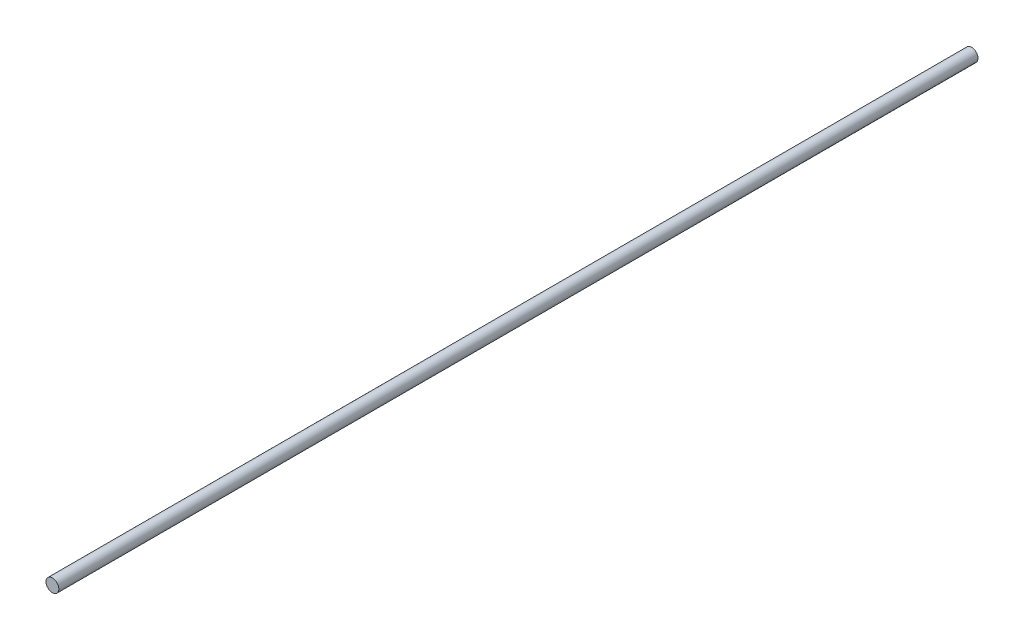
from build123d import *

# Parameters (mm, degrees)
SKETCH1_R           = 30
BOSS_EXTRUDE1_DEPTH = 4300


with BuildPart() as part:
    # Sketch1 → Boss-Extrude1 (new body)
    with BuildSketch(Plane.XY):
        Circle(SKETCH1_R)
    extrude(amount=-BOSS_EXTRUDE1_DEPTH)


solid = part.part
